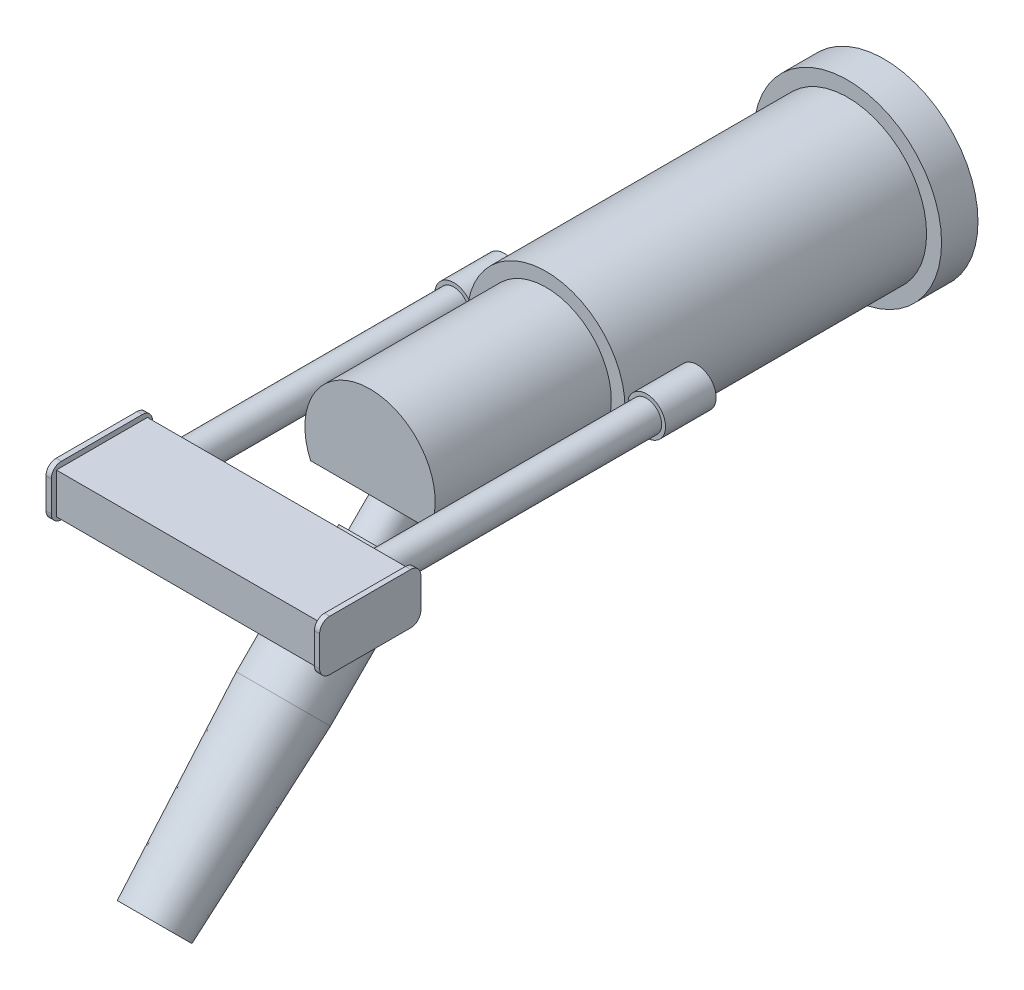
ISO-10303-21;
HEADER;
FILE_DESCRIPTION(('STEP AP214'),'2;1');
FILE_NAME('part.step','',(''),(''),'','','');
FILE_SCHEMA(('AUTOMOTIVE_DESIGN { 1 0 10303 214 1 1 1 1 }'));
ENDSEC;
DATA;
#1=APPLICATION_CONTEXT('core data for automotive mechanical design processes');
#2=APPLICATION_PROTOCOL_DEFINITION('international standard','automotive_design',2000,#1);
#3=PRODUCT_CONTEXT('',#1,'mechanical');
#4=PRODUCT('Part','Part','',(#3));
#5=PRODUCT_RELATED_PRODUCT_CATEGORY('part','',(#4));
#6=PRODUCT_DEFINITION_FORMATION('','',#4);
#7=PRODUCT_DEFINITION_CONTEXT('part definition',#1,'design');
#8=PRODUCT_DEFINITION('design','',#6,#7);
#9=PRODUCT_DEFINITION_SHAPE('','',#8);
#10=(LENGTH_UNIT() NAMED_UNIT(*) SI_UNIT(.MILLI.,.METRE.));
#11=(NAMED_UNIT(*) PLANE_ANGLE_UNIT() SI_UNIT($,.RADIAN.));
#12=(NAMED_UNIT(*) SI_UNIT($,.STERADIAN.) SOLID_ANGLE_UNIT());
#13=UNCERTAINTY_MEASURE_WITH_UNIT(LENGTH_MEASURE(1.E-05),#10,'distance_accuracy_value','');
#14=(GEOMETRIC_REPRESENTATION_CONTEXT(3) GLOBAL_UNCERTAINTY_ASSIGNED_CONTEXT((#13)) GLOBAL_UNIT_ASSIGNED_CONTEXT((#10,
#11,#12)) REPRESENTATION_CONTEXT('',''));
#15=CARTESIAN_POINT('',(0.,0.,0.));
#16=DIRECTION('',(0.,0.,1.));
#17=DIRECTION('',(1.,0.,0.));
#18=AXIS2_PLACEMENT_3D('',#15,#16,#17);
#19=CARTESIAN_POINT('',(0.,-181.25489002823,457.75929002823));
#20=DIRECTION('',(0.,0.707106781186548,-0.707106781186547));
#21=DIRECTION('',(0.,0.707106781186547,0.707106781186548));
#22=AXIS2_PLACEMENT_3D('',#19,#20,#21);
#23=PLANE('',#22);
#24=CARTESIAN_POINT('',(0.,-181.25489002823,457.75929002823));
#25=DIRECTION('',(0.,-0.707106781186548,0.707106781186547));
#26=DIRECTION('',(0.,-0.707106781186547,-0.707106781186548));
#27=AXIS2_PLACEMENT_3D('',#24,#25,#26);
#28=CIRCLE('',#27,19.1395542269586);
#29=CARTESIAN_POINT('',(0.,-194.788598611,444.22558144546));
#30=VERTEX_POINT('',#29);
#31=EDGE_CURVE('E60',#30,#30,#28,.T.);
#32=ORIENTED_EDGE('',*,*,#31,.T.);
#33=EDGE_LOOP('',(#32));
#34=FACE_BOUND('',#33,.T.);
#35=ADVANCED_FACE('F35',(#34),#23,.F.);
#36=CARTESIAN_POINT('',(0.,-30.8356,307.34));
#37=DIRECTION('',(0.,-0.707106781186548,0.707106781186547));
#38=DIRECTION('',(0.,-0.707106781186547,-0.707106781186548));
#39=AXIS2_PLACEMENT_3D('',#36,#37,#38);
#40=PLANE('',#39);
#41=CARTESIAN_POINT('',(0.,-30.8356,307.34));
#42=DIRECTION('',(0.,-0.707106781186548,0.707106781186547));
#43=DIRECTION('',(0.,-0.707106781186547,-0.707106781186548));
#44=AXIS2_PLACEMENT_3D('',#41,#42,#43);
#45=CIRCLE('',#44,12.573);
#46=CARTESIAN_POINT('',(0.,-39.7260535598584,298.449546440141));
#47=VERTEX_POINT('',#46);
#48=EDGE_CURVE('E11',#47,#47,#45,.T.);
#49=ORIENTED_EDGE('',*,*,#48,.F.);
#50=EDGE_LOOP('',(#49));
#51=FACE_BOUND('',#50,.T.);
#52=ADVANCED_FACE('F96',(#51),#40,.F.);
#53=CARTESIAN_POINT('',(0.,-30.8356,307.34));
#54=DIRECTION('',(0.,-0.707106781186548,0.707106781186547));
#55=DIRECTION('',(0.,-0.707106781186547,-0.707106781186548));
#56=AXIS2_PLACEMENT_3D('',#53,#54,#55);
#57=CYLINDRICAL_SURFACE('',#56,12.573);
#58=CARTESIAN_POINT('',(0.,-44.3059841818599,320.81038418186));
#59=DIRECTION('',(0.,-0.707106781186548,0.707106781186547));
#60=DIRECTION('',(0.,-0.707106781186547,-0.707106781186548));
#61=AXIS2_PLACEMENT_3D('',#58,#59,#60);
#62=CIRCLE('',#61,12.573);
#63=CARTESIAN_POINT('',(0.,-53.1964377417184,311.919930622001));
#64=VERTEX_POINT('',#63);
#65=EDGE_CURVE('E41',#64,#64,#62,.T.);
#66=ORIENTED_EDGE('',*,*,#65,.F.);
#67=EDGE_LOOP('',(#66));
#68=FACE_BOUND('',#67,.T.);
#69=ORIENTED_EDGE('',*,*,#48,.T.);
#70=EDGE_LOOP('',(#69));
#71=FACE_BOUND('',#70,.T.);
#72=ADVANCED_FACE('F91',(#68,#71),#57,.T.);
#73=CARTESIAN_POINT('',(0.,-35.4155306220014,329.700837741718));
#74=DIRECTION('',(0.,-0.707106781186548,0.707106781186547));
#75=DIRECTION('',(0.,-0.707106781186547,-0.707106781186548));
#76=AXIS2_PLACEMENT_3D('',#73,#74,#75);
#77=PLANE('',#76);
#78=CARTESIAN_POINT('',(0.,-44.3059841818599,320.81038418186));
#79=DIRECTION('',(0.,-0.707106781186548,0.707106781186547));
#80=DIRECTION('',(0.,-0.707106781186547,-0.707106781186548));
#81=AXIS2_PLACEMENT_3D('',#78,#79,#80);
#82=CIRCLE('',#81,17.4624999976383);
#83=CARTESIAN_POINT('',(0.,-56.65383634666,308.46253201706));
#84=VERTEX_POINT('',#83);
#85=EDGE_CURVE('E45',#84,#84,#82,.T.);
#86=ORIENTED_EDGE('',*,*,#85,.F.);
#87=EDGE_LOOP('',(#86));
#88=FACE_BOUND('',#87,.T.);
#89=ORIENTED_EDGE('',*,*,#65,.T.);
#90=EDGE_LOOP('',(#89));
#91=FACE_BOUND('',#90,.T.);
#92=ADVANCED_FACE('F86',(#88,#91),#77,.F.);
#93=CARTESIAN_POINT('',(0.,-30.8356,307.34));
#94=DIRECTION('',(0.,-0.707106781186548,0.707106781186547));
#95=DIRECTION('',(0.,-0.707106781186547,-0.707106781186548));
#96=AXIS2_PLACEMENT_3D('',#93,#94,#95);
#97=CYLINDRICAL_SURFACE('',#96,17.4624999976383);
#98=CARTESIAN_POINT('',(0.,-46.5510482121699,323.05544821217));
#99=DIRECTION('',(0.,-0.707106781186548,0.707106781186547));
#100=DIRECTION('',(0.,-0.707106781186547,-0.707106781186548));
#101=AXIS2_PLACEMENT_3D('',#98,#99,#100);
#102=CIRCLE('',#101,17.4624999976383);
#103=CARTESIAN_POINT('',(0.,-58.89890037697,310.70759604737));
#104=VERTEX_POINT('',#103);
#105=EDGE_CURVE('E49',#104,#104,#102,.T.);
#106=ORIENTED_EDGE('',*,*,#105,.F.);
#107=EDGE_LOOP('',(#106));
#108=FACE_BOUND('',#107,.T.);
#109=ORIENTED_EDGE('',*,*,#85,.T.);
#110=EDGE_LOOP('',(#109));
#111=FACE_BOUND('',#110,.T.);
#112=ADVANCED_FACE('F80',(#108,#111),#97,.T.);
#113=CARTESIAN_POINT('',(0.,-34.2031960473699,335.40330037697));
#114=DIRECTION('',(0.,-0.707106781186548,0.707106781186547));
#115=DIRECTION('',(0.,-0.707106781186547,-0.707106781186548));
#116=AXIS2_PLACEMENT_3D('',#113,#114,#115);
#117=PLANE('',#116);
#118=CARTESIAN_POINT('',(0.,-46.5510482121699,323.05544821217));
#119=DIRECTION('',(0.,-0.707106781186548,0.707106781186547));
#120=DIRECTION('',(0.,-0.707106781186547,-0.707106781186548));
#121=AXIS2_PLACEMENT_3D('',#118,#119,#120);
#122=CIRCLE('',#121,24.1299999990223);
#123=CARTESIAN_POINT('',(0.,-63.61353484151,305.99296158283));
#124=VERTEX_POINT('',#123);
#125=EDGE_CURVE('E54',#124,#124,#122,.T.);
#126=ORIENTED_EDGE('',*,*,#125,.F.);
#127=EDGE_LOOP('',(#126));
#128=FACE_BOUND('',#127,.T.);
#129=ORIENTED_EDGE('',*,*,#105,.T.);
#130=EDGE_LOOP('',(#129));
#131=FACE_BOUND('',#130,.T.);
#132=ADVANCED_FACE('F74',(#128,#131),#117,.F.);
#133=CARTESIAN_POINT('',(0.,-30.8356,307.34));
#134=DIRECTION('',(0.,-0.707106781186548,0.707106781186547));
#135=DIRECTION('',(0.,-0.707106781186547,-0.707106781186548));
#136=AXIS2_PLACEMENT_3D('',#133,#134,#135);
#137=CYLINDRICAL_SURFACE('',#136,24.1299999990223);
#138=CARTESIAN_POINT('',(0.,-100.43258493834,376.93698493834));
#139=DIRECTION('',(0.,-0.707106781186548,0.707106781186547));
#140=DIRECTION('',(0.,-0.707106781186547,-0.707106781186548));
#141=AXIS2_PLACEMENT_3D('',#138,#139,#140);
#142=CIRCLE('',#141,24.1299999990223);
#143=CARTESIAN_POINT('',(0.,-117.49507156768,359.874498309));
#144=VERTEX_POINT('',#143);
#145=EDGE_CURVE('E57',#144,#144,#142,.T.);
#146=ORIENTED_EDGE('',*,*,#145,.F.);
#147=EDGE_LOOP('',(#146));
#148=FACE_BOUND('',#147,.T.);
#149=ORIENTED_EDGE('',*,*,#125,.T.);
#150=EDGE_LOOP('',(#149));
#151=FACE_BOUND('',#150,.T.);
#152=ADVANCED_FACE('F68',(#148,#151),#137,.T.);
#153=CARTESIAN_POINT('',(0.,-100.43258493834,376.93698493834));
#154=DIRECTION('',(0.,0.707106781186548,-0.707106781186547));
#155=DIRECTION('',(0.,0.707106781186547,0.707106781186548));
#156=AXIS2_PLACEMENT_3D('',#153,#154,#155);
#157=CONICAL_SURFACE('',#156,24.1299999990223,0.0436332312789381);
#158=ORIENTED_EDGE('',*,*,#31,.F.);
#159=EDGE_LOOP('',(#158));
#160=FACE_BOUND('',#159,.T.);
#161=ORIENTED_EDGE('',*,*,#145,.T.);
#162=EDGE_LOOP('',(#161));
#163=FACE_BOUND('',#162,.T.);
#164=ADVANCED_FACE('F65',(#160,#163),#157,.T.);
#165=CLOSED_SHELL('',(#35,#52,#72,#92,#112,#132,#152,#164));
#166=MANIFOLD_SOLID_BREP('B2',#165);
#167=CARTESIAN_POINT('',(-85.852,9.52500000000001,433.705));
#168=DIRECTION('',(1.,0.,0.));
#169=DIRECTION('',(0.,0.,1.));
#170=AXIS2_PLACEMENT_3D('',#167,#168,#169);
#171=CYLINDRICAL_SURFACE('',#170,6.34999999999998);
#172=CARTESIAN_POINT('',(-82.5499999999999,9.52500000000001,433.705));
#173=DIRECTION('',(1.,0.,0.));
#174=DIRECTION('',(0.,0.,1.));
#175=AXIS2_PLACEMENT_3D('',#172,#173,#174);
#176=CIRCLE('',#175,6.34999999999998);
#177=CARTESIAN_POINT('',(-82.5499999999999,15.875,433.705));
#178=VERTEX_POINT('',#177);
#179=CARTESIAN_POINT('',(-82.5499999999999,9.52500000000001,440.055));
#180=VERTEX_POINT('',#179);
#181=EDGE_CURVE('E198',#178,#180,#176,.T.);
#182=ORIENTED_EDGE('',*,*,#181,.F.);
#183=DIRECTION('',(1.,0.,0.));
#184=VECTOR('',#183,1.);
#185=CARTESIAN_POINT('',(-85.852,15.875,433.705));
#186=LINE('',#185,#184);
#187=CARTESIAN_POINT('',(-85.852,15.875,433.705));
#188=VERTEX_POINT('',#187);
#189=EDGE_CURVE('E241',#188,#178,#186,.T.);
#190=ORIENTED_EDGE('',*,*,#189,.F.);
#191=CARTESIAN_POINT('',(-85.852,9.52500000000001,433.705));
#192=DIRECTION('',(1.,0.,0.));
#193=DIRECTION('',(0.,0.,1.));
#194=AXIS2_PLACEMENT_3D('',#191,#192,#193);
#195=CIRCLE('',#194,6.34999999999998);
#196=CARTESIAN_POINT('',(-85.852,9.52500000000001,440.055));
#197=VERTEX_POINT('',#196);
#198=EDGE_CURVE('E203',#188,#197,#195,.T.);
#199=ORIENTED_EDGE('',*,*,#198,.T.);
#200=DIRECTION('',(1.,0.,0.));
#201=VECTOR('',#200,1.);
#202=CARTESIAN_POINT('',(-85.852,9.52500000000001,440.055));
#203=LINE('',#202,#201);
#204=EDGE_CURVE('E33',#197,#180,#203,.T.);
#205=ORIENTED_EDGE('',*,*,#204,.T.);
#206=EDGE_LOOP('',(#182,#190,#199,#205));
#207=FACE_BOUND('',#206,.T.);
#208=ADVANCED_FACE('F126',(#207),#171,.T.);
#209=CARTESIAN_POINT('',(-85.852,9.52500000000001,440.055));
#210=DIRECTION('',(0.,0.,-1.));
#211=DIRECTION('',(1.,0.,0.));
#212=AXIS2_PLACEMENT_3D('',#209,#210,#211);
#213=PLANE('',#212);
#214=DIRECTION('',(0.,-1.,0.));
#215=VECTOR('',#214,1.);
#216=CARTESIAN_POINT('',(-82.5499999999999,9.52500000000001,440.055));
#217=LINE('',#216,#215);
#218=CARTESIAN_POINT('',(-82.5499999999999,-9.52500000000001,440.055));
#219=VERTEX_POINT('',#218);
#220=EDGE_CURVE('E189',#180,#219,#217,.T.);
#221=ORIENTED_EDGE('',*,*,#220,.F.);
#222=ORIENTED_EDGE('',*,*,#204,.F.);
#223=DIRECTION('',(0.,-1.,0.));
#224=VECTOR('',#223,1.);
#225=CARTESIAN_POINT('',(-85.852,9.52500000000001,440.055));
#226=LINE('',#225,#224);
#227=CARTESIAN_POINT('',(-85.852,-9.52500000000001,440.055));
#228=VERTEX_POINT('',#227);
#229=EDGE_CURVE('E223',#197,#228,#226,.T.);
#230=ORIENTED_EDGE('',*,*,#229,.T.);
#231=DIRECTION('',(1.,0.,0.));
#232=VECTOR('',#231,1.);
#233=CARTESIAN_POINT('',(-85.852,-9.52500000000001,440.055));
#234=LINE('',#233,#232);
#235=EDGE_CURVE('E133',#228,#219,#234,.T.);
#236=ORIENTED_EDGE('',*,*,#235,.T.);
#237=EDGE_LOOP('',(#221,#222,#230,#236));
#238=FACE_BOUND('',#237,.T.);
#239=ADVANCED_FACE('F190',(#238),#213,.F.);
#240=CARTESIAN_POINT('',(-85.852,-9.52500000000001,433.705));
#241=DIRECTION('',(1.,0.,0.));
#242=DIRECTION('',(0.,0.,1.));
#243=AXIS2_PLACEMENT_3D('',#240,#241,#242);
#244=CYLINDRICAL_SURFACE('',#243,6.34999999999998);
#245=CARTESIAN_POINT('',(-82.5499999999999,-9.52500000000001,433.705));
#246=DIRECTION('',(1.,0.,0.));
#247=DIRECTION('',(0.,0.,-1.));
#248=AXIS2_PLACEMENT_3D('',#245,#246,#247);
#249=CIRCLE('',#248,6.34999999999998);
#250=CARTESIAN_POINT('',(-82.5499999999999,-15.875,433.705));
#251=VERTEX_POINT('',#250);
#252=EDGE_CURVE('E197',#219,#251,#249,.T.);
#253=ORIENTED_EDGE('',*,*,#252,.F.);
#254=ORIENTED_EDGE('',*,*,#235,.F.);
#255=CARTESIAN_POINT('',(-85.852,-9.52500000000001,433.705));
#256=DIRECTION('',(1.,0.,0.));
#257=DIRECTION('',(0.,0.,-1.));
#258=AXIS2_PLACEMENT_3D('',#255,#256,#257);
#259=CIRCLE('',#258,6.34999999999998);
#260=CARTESIAN_POINT('',(-85.852,-15.875,433.705));
#261=VERTEX_POINT('',#260);
#262=EDGE_CURVE('E225',#228,#261,#259,.T.);
#263=ORIENTED_EDGE('',*,*,#262,.T.);
#264=DIRECTION('',(1.,0.,0.));
#265=VECTOR('',#264,1.);
#266=CARTESIAN_POINT('',(-85.852,-15.875,433.705));
#267=LINE('',#266,#265);
#268=EDGE_CURVE('E255',#261,#251,#267,.T.);
#269=ORIENTED_EDGE('',*,*,#268,.T.);
#270=EDGE_LOOP('',(#253,#254,#263,#269));
#271=FACE_BOUND('',#270,.T.);
#272=ADVANCED_FACE('F259',(#271),#244,.T.);
#273=CARTESIAN_POINT('',(-85.852,-15.875,433.705));
#274=DIRECTION('',(0.,1.,0.));
#275=DIRECTION('',(0.,0.,1.));
#276=AXIS2_PLACEMENT_3D('',#273,#274,#275);
#277=PLANE('',#276);
#278=DIRECTION('',(0.,0.,-1.));
#279=VECTOR('',#278,1.);
#280=CARTESIAN_POINT('',(-82.5499999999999,-15.875,433.705));
#281=LINE('',#280,#279);
#282=CARTESIAN_POINT('',(-82.5499999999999,-15.875,382.905));
#283=VERTEX_POINT('',#282);
#284=EDGE_CURVE('E210',#251,#283,#281,.T.);
#285=ORIENTED_EDGE('',*,*,#284,.F.);
#286=ORIENTED_EDGE('',*,*,#268,.F.);
#287=DIRECTION('',(0.,0.,-1.));
#288=VECTOR('',#287,1.);
#289=CARTESIAN_POINT('',(-85.852,-15.875,433.705));
#290=LINE('',#289,#288);
#291=CARTESIAN_POINT('',(-85.852,-15.875,382.905));
#292=VERTEX_POINT('',#291);
#293=EDGE_CURVE('E228',#261,#292,#290,.T.);
#294=ORIENTED_EDGE('',*,*,#293,.T.);
#295=DIRECTION('',(1.,0.,0.));
#296=VECTOR('',#295,1.);
#297=CARTESIAN_POINT('',(-85.852,-15.875,382.905));
#298=LINE('',#297,#296);
#299=EDGE_CURVE('E252',#292,#283,#298,.T.);
#300=ORIENTED_EDGE('',*,*,#299,.T.);
#301=EDGE_LOOP('',(#285,#286,#294,#300));
#302=FACE_BOUND('',#301,.T.);
#303=ADVANCED_FACE('F261',(#302),#277,.F.);
#304=CARTESIAN_POINT('',(-85.852,-9.52500000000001,382.905));
#305=DIRECTION('',(1.,0.,0.));
#306=DIRECTION('',(0.,0.,1.));
#307=AXIS2_PLACEMENT_3D('',#304,#305,#306);
#308=CYLINDRICAL_SURFACE('',#307,6.35000000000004);
#309=CARTESIAN_POINT('',(-82.5499999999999,-9.52500000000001,382.905));
#310=DIRECTION('',(1.,0.,0.));
#311=DIRECTION('',(0.,0.,1.));
#312=AXIS2_PLACEMENT_3D('',#309,#310,#311);
#313=CIRCLE('',#312,6.35000000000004);
#314=CARTESIAN_POINT('',(-82.5499999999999,-9.52500000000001,376.555));
#315=VERTEX_POINT('',#314);
#316=EDGE_CURVE('E213',#283,#315,#313,.T.);
#317=ORIENTED_EDGE('',*,*,#316,.F.);
#318=ORIENTED_EDGE('',*,*,#299,.F.);
#319=CARTESIAN_POINT('',(-85.852,-9.52500000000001,382.905));
#320=DIRECTION('',(1.,0.,0.));
#321=DIRECTION('',(0.,0.,1.));
#322=AXIS2_PLACEMENT_3D('',#319,#320,#321);
#323=CIRCLE('',#322,6.35000000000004);
#324=CARTESIAN_POINT('',(-85.852,-9.52500000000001,376.555));
#325=VERTEX_POINT('',#324);
#326=EDGE_CURVE('E231',#292,#325,#323,.T.);
#327=ORIENTED_EDGE('',*,*,#326,.T.);
#328=DIRECTION('',(1.,0.,0.));
#329=VECTOR('',#328,1.);
#330=CARTESIAN_POINT('',(-85.852,-9.52500000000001,376.555));
#331=LINE('',#330,#329);
#332=EDGE_CURVE('E249',#325,#315,#331,.T.);
#333=ORIENTED_EDGE('',*,*,#332,.T.);
#334=EDGE_LOOP('',(#317,#318,#327,#333));
#335=FACE_BOUND('',#334,.T.);
#336=ADVANCED_FACE('F264',(#335),#308,.T.);
#337=CARTESIAN_POINT('',(-85.852,-9.52500000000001,376.555));
#338=DIRECTION('',(0.,0.,1.));
#339=DIRECTION('',(-1.,0.,0.));
#340=AXIS2_PLACEMENT_3D('',#337,#338,#339);
#341=PLANE('',#340);
#342=DIRECTION('',(0.,1.,0.));
#343=VECTOR('',#342,1.);
#344=CARTESIAN_POINT('',(-82.5499999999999,-9.52500000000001,376.555));
#345=LINE('',#344,#343);
#346=CARTESIAN_POINT('',(-82.5499999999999,9.52500000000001,376.555));
#347=VERTEX_POINT('',#346);
#348=EDGE_CURVE('E216',#315,#347,#345,.T.);
#349=ORIENTED_EDGE('',*,*,#348,.F.);
#350=ORIENTED_EDGE('',*,*,#332,.F.);
#351=DIRECTION('',(0.,1.,0.));
#352=VECTOR('',#351,1.);
#353=CARTESIAN_POINT('',(-85.852,-9.52500000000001,376.555));
#354=LINE('',#353,#352);
#355=CARTESIAN_POINT('',(-85.852,9.52500000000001,376.555));
#356=VERTEX_POINT('',#355);
#357=EDGE_CURVE('E234',#325,#356,#354,.T.);
#358=ORIENTED_EDGE('',*,*,#357,.T.);
#359=DIRECTION('',(1.,0.,0.));
#360=VECTOR('',#359,1.);
#361=CARTESIAN_POINT('',(-85.852,9.52500000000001,376.555));
#362=LINE('',#361,#360);
#363=EDGE_CURVE('E246',#356,#347,#362,.T.);
#364=ORIENTED_EDGE('',*,*,#363,.T.);
#365=EDGE_LOOP('',(#349,#350,#358,#364));
#366=FACE_BOUND('',#365,.T.);
#367=ADVANCED_FACE('F267',(#366),#341,.F.);
#368=CARTESIAN_POINT('',(-85.852,9.52500000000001,382.905));
#369=DIRECTION('',(1.,0.,0.));
#370=DIRECTION('',(0.,0.,1.));
#371=AXIS2_PLACEMENT_3D('',#368,#369,#370);
#372=CYLINDRICAL_SURFACE('',#371,6.35000000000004);
#373=CARTESIAN_POINT('',(-82.5499999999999,9.52500000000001,382.905));
#374=DIRECTION('',(1.,0.,0.));
#375=DIRECTION('',(0.,0.,1.));
#376=AXIS2_PLACEMENT_3D('',#373,#374,#375);
#377=CIRCLE('',#376,6.35000000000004);
#378=CARTESIAN_POINT('',(-82.5499999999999,15.8750000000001,382.905));
#379=VERTEX_POINT('',#378);
#380=EDGE_CURVE('E219',#347,#379,#377,.T.);
#381=ORIENTED_EDGE('',*,*,#380,.F.);
#382=ORIENTED_EDGE('',*,*,#363,.F.);
#383=CARTESIAN_POINT('',(-85.852,9.52500000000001,382.905));
#384=DIRECTION('',(1.,0.,0.));
#385=DIRECTION('',(0.,0.,1.));
#386=AXIS2_PLACEMENT_3D('',#383,#384,#385);
#387=CIRCLE('',#386,6.35000000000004);
#388=CARTESIAN_POINT('',(-85.852,15.8750000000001,382.905));
#389=VERTEX_POINT('',#388);
#390=EDGE_CURVE('E237',#356,#389,#387,.T.);
#391=ORIENTED_EDGE('',*,*,#390,.T.);
#392=DIRECTION('',(1.,0.,0.));
#393=VECTOR('',#392,1.);
#394=CARTESIAN_POINT('',(-85.852,15.8750000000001,382.905));
#395=LINE('',#394,#393);
#396=EDGE_CURVE('E243',#389,#379,#395,.T.);
#397=ORIENTED_EDGE('',*,*,#396,.T.);
#398=EDGE_LOOP('',(#381,#382,#391,#397));
#399=FACE_BOUND('',#398,.T.);
#400=ADVANCED_FACE('F270',(#399),#372,.T.);
#401=CARTESIAN_POINT('',(-85.852,15.875,382.905));
#402=DIRECTION('',(0.,-1.,0.));
#403=DIRECTION('',(0.,0.,-1.));
#404=AXIS2_PLACEMENT_3D('',#401,#402,#403);
#405=PLANE('',#404);
#406=DIRECTION('',(0.,0.,1.));
#407=VECTOR('',#406,1.);
#408=CARTESIAN_POINT('',(-82.5499999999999,15.875,382.905));
#409=LINE('',#408,#407);
#410=EDGE_CURVE('E206',#379,#178,#409,.T.);
#411=ORIENTED_EDGE('',*,*,#410,.F.);
#412=ORIENTED_EDGE('',*,*,#396,.F.);
#413=DIRECTION('',(0.,0.,1.));
#414=VECTOR('',#413,1.);
#415=CARTESIAN_POINT('',(-85.852,15.875,382.905));
#416=LINE('',#415,#414);
#417=EDGE_CURVE('E140',#389,#188,#416,.T.);
#418=ORIENTED_EDGE('',*,*,#417,.T.);
#419=ORIENTED_EDGE('',*,*,#189,.T.);
#420=EDGE_LOOP('',(#411,#412,#418,#419));
#421=FACE_BOUND('',#420,.T.);
#422=ADVANCED_FACE('F271',(#421),#405,.F.);
#423=CARTESIAN_POINT('',(-85.852,9.52500000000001,433.705));
#424=DIRECTION('',(1.,0.,0.));
#425=DIRECTION('',(0.,0.,1.));
#426=AXIS2_PLACEMENT_3D('',#423,#424,#425);
#427=PLANE('',#426);
#428=ORIENTED_EDGE('',*,*,#198,.F.);
#429=ORIENTED_EDGE('',*,*,#417,.F.);
#430=ORIENTED_EDGE('',*,*,#390,.F.);
#431=ORIENTED_EDGE('',*,*,#357,.F.);
#432=ORIENTED_EDGE('',*,*,#326,.F.);
#433=ORIENTED_EDGE('',*,*,#293,.F.);
#434=ORIENTED_EDGE('',*,*,#262,.F.);
#435=ORIENTED_EDGE('',*,*,#229,.F.);
#436=EDGE_LOOP('',(#428,#429,#430,#431,#432,#433,#434,#435));
#437=FACE_BOUND('',#436,.T.);
#438=ADVANCED_FACE('F273',(#437),#427,.F.);
#439=CARTESIAN_POINT('',(-82.5499999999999,9.52500000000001,433.705));
#440=DIRECTION('',(1.,0.,0.));
#441=DIRECTION('',(0.,0.,1.));
#442=AXIS2_PLACEMENT_3D('',#439,#440,#441);
#443=PLANE('',#442);
#444=ORIENTED_EDGE('',*,*,#181,.T.);
#445=ORIENTED_EDGE('',*,*,#220,.T.);
#446=ORIENTED_EDGE('',*,*,#252,.T.);
#447=ORIENTED_EDGE('',*,*,#284,.T.);
#448=ORIENTED_EDGE('',*,*,#316,.T.);
#449=ORIENTED_EDGE('',*,*,#348,.T.);
#450=ORIENTED_EDGE('',*,*,#380,.T.);
#451=ORIENTED_EDGE('',*,*,#410,.T.);
#452=EDGE_LOOP('',(#444,#445,#446,#447,#448,#449,#450,#451));
#453=FACE_BOUND('',#452,.T.);
#454=ADVANCED_FACE('F204',(#453),#443,.T.);
#455=CLOSED_SHELL('',(#208,#239,#272,#303,#336,#367,#400,#422,#438,#454));
#456=MANIFOLD_SOLID_BREP('B6',#455);
#457=CARTESIAN_POINT('',(-60.4519999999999,0.,379.73));
#458=DIRECTION('',(0.,0.,-1.));
#459=DIRECTION('',(1.,0.,0.));
#460=AXIS2_PLACEMENT_3D('',#457,#458,#459);
#461=CYLINDRICAL_SURFACE('',#460,9.52500000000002);
#462=CARTESIAN_POINT('',(-60.4519999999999,0.,379.73));
#463=DIRECTION('',(0.,0.,-1.));
#464=DIRECTION('',(-1.,0.,0.));
#465=AXIS2_PLACEMENT_3D('',#462,#463,#464);
#466=CIRCLE('',#465,9.52500000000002);
#467=CARTESIAN_POINT('',(-69.977,0.,379.73));
#468=VERTEX_POINT('',#467);
#469=EDGE_CURVE('E125',#468,#468,#466,.T.);
#470=ORIENTED_EDGE('',*,*,#469,.T.);
#471=EDGE_LOOP('',(#470));
#472=FACE_BOUND('',#471,.T.);
#473=CARTESIAN_POINT('',(-60.4519999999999,0.,209.55));
#474=DIRECTION('',(0.,0.,-1.));
#475=DIRECTION('',(-1.,0.,0.));
#476=AXIS2_PLACEMENT_3D('',#473,#474,#475);
#477=CIRCLE('',#476,9.52500000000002);
#478=CARTESIAN_POINT('',(-69.977,0.,209.55));
#479=VERTEX_POINT('',#478);
#480=EDGE_CURVE('E327',#479,#479,#477,.T.);
#481=ORIENTED_EDGE('',*,*,#480,.F.);
#482=EDGE_LOOP('',(#481));
#483=FACE_BOUND('',#482,.T.);
#484=ADVANCED_FACE('F321',(#472,#483),#461,.T.);
#485=CARTESIAN_POINT('',(-60.4519999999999,0.,379.73));
#486=DIRECTION('',(0.,0.,1.));
#487=DIRECTION('',(-1.,0.,0.));
#488=AXIS2_PLACEMENT_3D('',#485,#486,#487);
#489=PLANE('',#488);
#490=ORIENTED_EDGE('',*,*,#469,.F.);
#491=EDGE_LOOP('',(#490));
#492=FACE_BOUND('',#491,.T.);
#493=ADVANCED_FACE('F336',(#492),#489,.T.);
#494=CARTESIAN_POINT('',(-60.4519999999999,0.,209.55));
#495=DIRECTION('',(0.,0.,1.));
#496=DIRECTION('',(-1.,0.,0.));
#497=AXIS2_PLACEMENT_3D('',#494,#495,#496);
#498=PLANE('',#497);
#499=ORIENTED_EDGE('',*,*,#480,.T.);
#500=EDGE_LOOP('',(#499));
#501=FACE_BOUND('',#500,.T.);
#502=ADVANCED_FACE('F333',(#501),#498,.F.);
#503=CLOSED_SHELL('',(#484,#493,#502));
#504=MANIFOLD_SOLID_BREP('B27',#503);
#505=CARTESIAN_POINT('',(-60.4519999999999,0.,209.55));
#506=DIRECTION('',(0.,0.,-1.));
#507=DIRECTION('',(1.,0.,0.));
#508=AXIS2_PLACEMENT_3D('',#505,#506,#507);
#509=CYLINDRICAL_SURFACE('',#508,11.938);
#510=CARTESIAN_POINT('',(-60.4519999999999,0.,209.55));
#511=DIRECTION('',(0.,0.,-1.));
#512=DIRECTION('',(-1.,0.,0.));
#513=AXIS2_PLACEMENT_3D('',#510,#511,#512);
#514=CIRCLE('',#513,11.938);
#515=CARTESIAN_POINT('',(-72.3899999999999,0.,209.55));
#516=VERTEX_POINT('',#515);
#517=EDGE_CURVE('E320',#516,#516,#514,.T.);
#518=ORIENTED_EDGE('',*,*,#517,.T.);
#519=EDGE_LOOP('',(#518));
#520=FACE_BOUND('',#519,.T.);
#521=CARTESIAN_POINT('',(-60.4519999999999,0.,177.8));
#522=DIRECTION('',(0.,0.,-1.));
#523=DIRECTION('',(-1.,0.,0.));
#524=AXIS2_PLACEMENT_3D('',#521,#522,#523);
#525=CIRCLE('',#524,11.938);
#526=CARTESIAN_POINT('',(-72.3899999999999,0.,177.8));
#527=VERTEX_POINT('',#526);
#528=EDGE_CURVE('E365',#527,#527,#525,.T.);
#529=ORIENTED_EDGE('',*,*,#528,.F.);
#530=EDGE_LOOP('',(#529));
#531=FACE_BOUND('',#530,.T.);
#532=ADVANCED_FACE('F359',(#520,#531),#509,.T.);
#533=CARTESIAN_POINT('',(-60.4519999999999,0.,209.55));
#534=DIRECTION('',(0.,0.,1.));
#535=DIRECTION('',(-1.,0.,0.));
#536=AXIS2_PLACEMENT_3D('',#533,#534,#535);
#537=PLANE('',#536);
#538=ORIENTED_EDGE('',*,*,#517,.F.);
#539=EDGE_LOOP('',(#538));
#540=FACE_BOUND('',#539,.T.);
#541=ADVANCED_FACE('F374',(#540),#537,.T.);
#542=CARTESIAN_POINT('',(-60.4519999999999,0.,177.8));
#543=DIRECTION('',(0.,0.,1.));
#544=DIRECTION('',(-1.,0.,0.));
#545=AXIS2_PLACEMENT_3D('',#542,#543,#544);
#546=PLANE('',#545);
#547=ORIENTED_EDGE('',*,*,#528,.T.);
#548=EDGE_LOOP('',(#547));
#549=FACE_BOUND('',#548,.T.);
#550=ADVANCED_FACE('F371',(#549),#546,.F.);
#551=CLOSED_SHELL('',(#532,#541,#550));
#552=MANIFOLD_SOLID_BREP('B120',#551);
#553=CARTESIAN_POINT('',(85.852,9.52500000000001,433.705));
#554=DIRECTION('',(-1.,0.,0.));
#555=DIRECTION('',(0.,0.,1.));
#556=AXIS2_PLACEMENT_3D('',#553,#554,#555);
#557=CYLINDRICAL_SURFACE('',#556,6.34999999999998);
#558=CARTESIAN_POINT('',(82.5499999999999,9.52500000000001,433.705));
#559=DIRECTION('',(1.,0.,0.));
#560=DIRECTION('',(0.,0.,1.));
#561=AXIS2_PLACEMENT_3D('',#558,#559,#560);
#562=CIRCLE('',#561,6.34999999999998);
#563=CARTESIAN_POINT('',(82.5499999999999,15.875,433.705));
#564=VERTEX_POINT('',#563);
#565=CARTESIAN_POINT('',(82.5499999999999,9.52500000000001,440.055));
#566=VERTEX_POINT('',#565);
#567=EDGE_CURVE('E465',#564,#566,#562,.T.);
#568=ORIENTED_EDGE('',*,*,#567,.T.);
#569=DIRECTION('',(-1.,0.,0.));
#570=VECTOR('',#569,1.);
#571=CARTESIAN_POINT('',(85.852,9.52500000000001,440.055));
#572=LINE('',#571,#570);
#573=CARTESIAN_POINT('',(85.852,9.52500000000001,440.055));
#574=VERTEX_POINT('',#573);
#575=EDGE_CURVE('E357',#574,#566,#572,.T.);
#576=ORIENTED_EDGE('',*,*,#575,.F.);
#577=CARTESIAN_POINT('',(85.852,9.52500000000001,433.705));
#578=DIRECTION('',(1.,0.,0.));
#579=DIRECTION('',(0.,0.,1.));
#580=AXIS2_PLACEMENT_3D('',#577,#578,#579);
#581=CIRCLE('',#580,6.34999999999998);
#582=CARTESIAN_POINT('',(85.852,15.875,433.705));
#583=VERTEX_POINT('',#582);
#584=EDGE_CURVE('E492',#583,#574,#581,.T.);
#585=ORIENTED_EDGE('',*,*,#584,.F.);
#586=DIRECTION('',(-1.,0.,0.));
#587=VECTOR('',#586,1.);
#588=CARTESIAN_POINT('',(85.852,15.875,433.705));
#589=LINE('',#588,#587);
#590=EDGE_CURVE('E478',#583,#564,#589,.T.);
#591=ORIENTED_EDGE('',*,*,#590,.T.);
#592=EDGE_LOOP('',(#568,#576,#585,#591));
#593=FACE_BOUND('',#592,.T.);
#594=ADVANCED_FACE('F397',(#593),#557,.T.);
#595=CARTESIAN_POINT('',(85.852,9.52500000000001,440.055));
#596=DIRECTION('',(0.,0.,-1.));
#597=DIRECTION('',(-1.,0.,0.));
#598=AXIS2_PLACEMENT_3D('',#595,#596,#597);
#599=PLANE('',#598);
#600=DIRECTION('',(0.,-1.,0.));
#601=VECTOR('',#600,1.);
#602=CARTESIAN_POINT('',(82.5499999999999,9.52500000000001,440.055));
#603=LINE('',#602,#601);
#604=CARTESIAN_POINT('',(82.5499999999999,-9.52500000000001,440.055));
#605=VERTEX_POINT('',#604);
#606=EDGE_CURVE('E461',#566,#605,#603,.T.);
#607=ORIENTED_EDGE('',*,*,#606,.T.);
#608=DIRECTION('',(-1.,0.,0.));
#609=VECTOR('',#608,1.);
#610=CARTESIAN_POINT('',(85.852,-9.52500000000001,440.055));
#611=LINE('',#610,#609);
#612=CARTESIAN_POINT('',(85.852,-9.52500000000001,440.055));
#613=VERTEX_POINT('',#612);
#614=EDGE_CURVE('E404',#613,#605,#611,.T.);
#615=ORIENTED_EDGE('',*,*,#614,.F.);
#616=DIRECTION('',(0.,-1.,0.));
#617=VECTOR('',#616,1.);
#618=CARTESIAN_POINT('',(85.852,9.52500000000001,440.055));
#619=LINE('',#618,#617);
#620=EDGE_CURVE('E474',#574,#613,#619,.T.);
#621=ORIENTED_EDGE('',*,*,#620,.F.);
#622=ORIENTED_EDGE('',*,*,#575,.T.);
#623=EDGE_LOOP('',(#607,#615,#621,#622));
#624=FACE_BOUND('',#623,.T.);
#625=ADVANCED_FACE('F473',(#624),#599,.F.);
#626=CARTESIAN_POINT('',(85.852,-9.52500000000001,433.705));
#627=DIRECTION('',(-1.,0.,0.));
#628=DIRECTION('',(0.,0.,1.));
#629=AXIS2_PLACEMENT_3D('',#626,#627,#628);
#630=CYLINDRICAL_SURFACE('',#629,6.34999999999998);
#631=CARTESIAN_POINT('',(82.5499999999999,-9.52500000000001,433.705));
#632=DIRECTION('',(1.,0.,0.));
#633=DIRECTION('',(0.,0.,-1.));
#634=AXIS2_PLACEMENT_3D('',#631,#632,#633);
#635=CIRCLE('',#634,6.34999999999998);
#636=CARTESIAN_POINT('',(82.5499999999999,-15.875,433.705));
#637=VERTEX_POINT('',#636);
#638=EDGE_CURVE('E467',#605,#637,#635,.T.);
#639=ORIENTED_EDGE('',*,*,#638,.T.);
#640=DIRECTION('',(-1.,0.,0.));
#641=VECTOR('',#640,1.);
#642=CARTESIAN_POINT('',(85.852,-15.875,433.705));
#643=LINE('',#642,#641);
#644=CARTESIAN_POINT('',(85.852,-15.875,433.705));
#645=VERTEX_POINT('',#644);
#646=EDGE_CURVE('E518',#645,#637,#643,.T.);
#647=ORIENTED_EDGE('',*,*,#646,.F.);
#648=CARTESIAN_POINT('',(85.852,-9.52500000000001,433.705));
#649=DIRECTION('',(1.,0.,0.));
#650=DIRECTION('',(0.,0.,-1.));
#651=AXIS2_PLACEMENT_3D('',#648,#649,#650);
#652=CIRCLE('',#651,6.34999999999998);
#653=EDGE_CURVE('E495',#613,#645,#652,.T.);
#654=ORIENTED_EDGE('',*,*,#653,.F.);
#655=ORIENTED_EDGE('',*,*,#614,.T.);
#656=EDGE_LOOP('',(#639,#647,#654,#655));
#657=FACE_BOUND('',#656,.T.);
#658=ADVANCED_FACE('F522',(#657),#630,.T.);
#659=CARTESIAN_POINT('',(85.852,-15.875,433.705));
#660=DIRECTION('',(0.,1.,0.));
#661=DIRECTION('',(0.,0.,1.));
#662=AXIS2_PLACEMENT_3D('',#659,#660,#661);
#663=PLANE('',#662);
#664=DIRECTION('',(0.,0.,-1.));
#665=VECTOR('',#664,1.);
#666=CARTESIAN_POINT('',(82.5499999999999,-15.875,433.705));
#667=LINE('',#666,#665);
#668=CARTESIAN_POINT('',(82.5499999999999,-15.875,382.905));
#669=VERTEX_POINT('',#668);
#670=EDGE_CURVE('E482',#637,#669,#667,.T.);
#671=ORIENTED_EDGE('',*,*,#670,.T.);
#672=DIRECTION('',(-1.,0.,0.));
#673=VECTOR('',#672,1.);
#674=CARTESIAN_POINT('',(85.852,-15.875,382.905));
#675=LINE('',#674,#673);
#676=CARTESIAN_POINT('',(85.852,-15.875,382.905));
#677=VERTEX_POINT('',#676);
#678=EDGE_CURVE('E515',#677,#669,#675,.T.);
#679=ORIENTED_EDGE('',*,*,#678,.F.);
#680=DIRECTION('',(0.,0.,-1.));
#681=VECTOR('',#680,1.);
#682=CARTESIAN_POINT('',(85.852,-15.875,433.705));
#683=LINE('',#682,#681);
#684=EDGE_CURVE('E497',#645,#677,#683,.T.);
#685=ORIENTED_EDGE('',*,*,#684,.F.);
#686=ORIENTED_EDGE('',*,*,#646,.T.);
#687=EDGE_LOOP('',(#671,#679,#685,#686));
#688=FACE_BOUND('',#687,.T.);
#689=ADVANCED_FACE('F530',(#688),#663,.F.);
#690=CARTESIAN_POINT('',(85.852,-9.52500000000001,382.905));
#691=DIRECTION('',(-1.,0.,0.));
#692=DIRECTION('',(0.,0.,1.));
#693=AXIS2_PLACEMENT_3D('',#690,#691,#692);
#694=CYLINDRICAL_SURFACE('',#693,6.35000000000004);
#695=CARTESIAN_POINT('',(82.5499999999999,-9.52500000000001,382.905));
#696=DIRECTION('',(1.,0.,0.));
#697=DIRECTION('',(0.,0.,1.));
#698=AXIS2_PLACEMENT_3D('',#695,#696,#697);
#699=CIRCLE('',#698,6.35000000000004);
#700=CARTESIAN_POINT('',(82.5499999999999,-9.52500000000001,376.555));
#701=VERTEX_POINT('',#700);
#702=EDGE_CURVE('E484',#669,#701,#699,.T.);
#703=ORIENTED_EDGE('',*,*,#702,.T.);
#704=DIRECTION('',(-1.,0.,0.));
#705=VECTOR('',#704,1.);
#706=CARTESIAN_POINT('',(85.852,-9.52500000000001,376.555));
#707=LINE('',#706,#705);
#708=CARTESIAN_POINT('',(85.852,-9.52500000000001,376.555));
#709=VERTEX_POINT('',#708);
#710=EDGE_CURVE('E512',#709,#701,#707,.T.);
#711=ORIENTED_EDGE('',*,*,#710,.F.);
#712=CARTESIAN_POINT('',(85.852,-9.52500000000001,382.905));
#713=DIRECTION('',(1.,0.,0.));
#714=DIRECTION('',(0.,0.,1.));
#715=AXIS2_PLACEMENT_3D('',#712,#713,#714);
#716=CIRCLE('',#715,6.35000000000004);
#717=EDGE_CURVE('E499',#677,#709,#716,.T.);
#718=ORIENTED_EDGE('',*,*,#717,.F.);
#719=ORIENTED_EDGE('',*,*,#678,.T.);
#720=EDGE_LOOP('',(#703,#711,#718,#719));
#721=FACE_BOUND('',#720,.T.);
#722=ADVANCED_FACE('F533',(#721),#694,.T.);
#723=CARTESIAN_POINT('',(85.852,-9.52500000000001,376.555));
#724=DIRECTION('',(0.,0.,1.));
#725=DIRECTION('',(1.,0.,0.));
#726=AXIS2_PLACEMENT_3D('',#723,#724,#725);
#727=PLANE('',#726);
#728=DIRECTION('',(0.,1.,0.));
#729=VECTOR('',#728,1.);
#730=CARTESIAN_POINT('',(82.5499999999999,-9.52500000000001,376.555));
#731=LINE('',#730,#729);
#732=CARTESIAN_POINT('',(82.5499999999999,9.52500000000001,376.555));
#733=VERTEX_POINT('',#732);
#734=EDGE_CURVE('E486',#701,#733,#731,.T.);
#735=ORIENTED_EDGE('',*,*,#734,.T.);
#736=DIRECTION('',(-1.,0.,0.));
#737=VECTOR('',#736,1.);
#738=CARTESIAN_POINT('',(85.852,9.52500000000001,376.555));
#739=LINE('',#738,#737);
#740=CARTESIAN_POINT('',(85.852,9.52500000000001,376.555));
#741=VERTEX_POINT('',#740);
#742=EDGE_CURVE('E509',#741,#733,#739,.T.);
#743=ORIENTED_EDGE('',*,*,#742,.F.);
#744=DIRECTION('',(0.,1.,0.));
#745=VECTOR('',#744,1.);
#746=CARTESIAN_POINT('',(85.852,-9.52500000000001,376.555));
#747=LINE('',#746,#745);
#748=EDGE_CURVE('E501',#709,#741,#747,.T.);
#749=ORIENTED_EDGE('',*,*,#748,.F.);
#750=ORIENTED_EDGE('',*,*,#710,.T.);
#751=EDGE_LOOP('',(#735,#743,#749,#750));
#752=FACE_BOUND('',#751,.T.);
#753=ADVANCED_FACE('F538',(#752),#727,.F.);
#754=CARTESIAN_POINT('',(85.852,9.52500000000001,382.905));
#755=DIRECTION('',(-1.,0.,0.));
#756=DIRECTION('',(0.,0.,1.));
#757=AXIS2_PLACEMENT_3D('',#754,#755,#756);
#758=CYLINDRICAL_SURFACE('',#757,6.35000000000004);
#759=CARTESIAN_POINT('',(82.5499999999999,9.52500000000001,382.905));
#760=DIRECTION('',(1.,0.,0.));
#761=DIRECTION('',(0.,0.,1.));
#762=AXIS2_PLACEMENT_3D('',#759,#760,#761);
#763=CIRCLE('',#762,6.35000000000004);
#764=CARTESIAN_POINT('',(82.5499999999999,15.8750000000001,382.905));
#765=VERTEX_POINT('',#764);
#766=EDGE_CURVE('E488',#733,#765,#763,.T.);
#767=ORIENTED_EDGE('',*,*,#766,.T.);
#768=DIRECTION('',(-1.,0.,0.));
#769=VECTOR('',#768,1.);
#770=CARTESIAN_POINT('',(85.852,15.8750000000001,382.905));
#771=LINE('',#770,#769);
#772=CARTESIAN_POINT('',(85.852,15.8750000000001,382.905));
#773=VERTEX_POINT('',#772);
#774=EDGE_CURVE('E506',#773,#765,#771,.T.);
#775=ORIENTED_EDGE('',*,*,#774,.F.);
#776=CARTESIAN_POINT('',(85.852,9.52500000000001,382.905));
#777=DIRECTION('',(1.,0.,0.));
#778=DIRECTION('',(0.,0.,1.));
#779=AXIS2_PLACEMENT_3D('',#776,#777,#778);
#780=CIRCLE('',#779,6.35000000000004);
#781=EDGE_CURVE('E416',#741,#773,#780,.T.);
#782=ORIENTED_EDGE('',*,*,#781,.F.);
#783=ORIENTED_EDGE('',*,*,#742,.T.);
#784=EDGE_LOOP('',(#767,#775,#782,#783));
#785=FACE_BOUND('',#784,.T.);
#786=ADVANCED_FACE('F541',(#785),#758,.T.);
#787=CARTESIAN_POINT('',(85.852,15.875,382.905));
#788=DIRECTION('',(0.,-1.,0.));
#789=DIRECTION('',(0.,0.,-1.));
#790=AXIS2_PLACEMENT_3D('',#787,#788,#789);
#791=PLANE('',#790);
#792=DIRECTION('',(0.,0.,1.));
#793=VECTOR('',#792,1.);
#794=CARTESIAN_POINT('',(82.5499999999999,15.875,382.905));
#795=LINE('',#794,#793);
#796=EDGE_CURVE('E490',#765,#564,#795,.T.);
#797=ORIENTED_EDGE('',*,*,#796,.T.);
#798=ORIENTED_EDGE('',*,*,#590,.F.);
#799=DIRECTION('',(0.,0.,1.));
#800=VECTOR('',#799,1.);
#801=CARTESIAN_POINT('',(85.852,15.875,382.905));
#802=LINE('',#801,#800);
#803=EDGE_CURVE('E411',#773,#583,#802,.T.);
#804=ORIENTED_EDGE('',*,*,#803,.F.);
#805=ORIENTED_EDGE('',*,*,#774,.T.);
#806=EDGE_LOOP('',(#797,#798,#804,#805));
#807=FACE_BOUND('',#806,.T.);
#808=ADVANCED_FACE('F543',(#807),#791,.F.);
#809=CARTESIAN_POINT('',(85.852,9.52500000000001,433.705));
#810=DIRECTION('',(-1.,0.,0.));
#811=DIRECTION('',(0.,0.,1.));
#812=AXIS2_PLACEMENT_3D('',#809,#810,#811);
#813=PLANE('',#812);
#814=ORIENTED_EDGE('',*,*,#584,.T.);
#815=ORIENTED_EDGE('',*,*,#620,.T.);
#816=ORIENTED_EDGE('',*,*,#653,.T.);
#817=ORIENTED_EDGE('',*,*,#684,.T.);
#818=ORIENTED_EDGE('',*,*,#717,.T.);
#819=ORIENTED_EDGE('',*,*,#748,.T.);
#820=ORIENTED_EDGE('',*,*,#781,.T.);
#821=ORIENTED_EDGE('',*,*,#803,.T.);
#822=EDGE_LOOP('',(#814,#815,#816,#817,#818,#819,#820,#821));
#823=FACE_BOUND('',#822,.T.);
#824=ADVANCED_FACE('F525',(#823),#813,.F.);
#825=CARTESIAN_POINT('',(82.5499999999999,9.52500000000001,433.705));
#826=DIRECTION('',(-1.,0.,0.));
#827=DIRECTION('',(0.,0.,1.));
#828=AXIS2_PLACEMENT_3D('',#825,#826,#827);
#829=PLANE('',#828);
#830=ORIENTED_EDGE('',*,*,#567,.F.);
#831=ORIENTED_EDGE('',*,*,#796,.F.);
#832=ORIENTED_EDGE('',*,*,#766,.F.);
#833=ORIENTED_EDGE('',*,*,#734,.F.);
#834=ORIENTED_EDGE('',*,*,#702,.F.);
#835=ORIENTED_EDGE('',*,*,#670,.F.);
#836=ORIENTED_EDGE('',*,*,#638,.F.);
#837=ORIENTED_EDGE('',*,*,#606,.F.);
#838=EDGE_LOOP('',(#830,#831,#832,#833,#834,#835,#836,#837));
#839=FACE_BOUND('',#838,.T.);
#840=ADVANCED_FACE('F462',(#839),#829,.T.);
#841=CLOSED_SHELL('',(#594,#625,#658,#689,#722,#753,#786,#808,#824,#840));
#842=MANIFOLD_SOLID_BREP('B315',#841);
#843=CARTESIAN_POINT('',(-82.5499999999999,-12.7,436.88));
#844=DIRECTION('',(1.,0.,0.));
#845=DIRECTION('',(0.,0.,-1.));
#846=AXIS2_PLACEMENT_3D('',#843,#844,#845);
#847=PLANE('',#846);
#848=DIRECTION('',(0.,-1.,0.));
#849=VECTOR('',#848,1.);
#850=CARTESIAN_POINT('',(-82.5499999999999,-12.7,379.73));
#851=LINE('',#850,#849);
#852=CARTESIAN_POINT('',(-82.5499999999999,12.7,379.73));
#853=VERTEX_POINT('',#852);
#854=CARTESIAN_POINT('',(-82.5499999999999,-12.7,379.73));
#855=VERTEX_POINT('',#854);
#856=EDGE_CURVE('E636',#853,#855,#851,.T.);
#857=ORIENTED_EDGE('',*,*,#856,.T.);
#858=DIRECTION('',(0.,0.,-1.));
#859=VECTOR('',#858,1.);
#860=CARTESIAN_POINT('',(-82.5499999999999,-12.7,436.88));
#861=LINE('',#860,#859);
#862=CARTESIAN_POINT('',(-82.5499999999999,-12.7,436.88));
#863=VERTEX_POINT('',#862);
#864=EDGE_CURVE('E395',#863,#855,#861,.T.);
#865=ORIENTED_EDGE('',*,*,#864,.F.);
#866=DIRECTION('',(0.,-1.,0.));
#867=VECTOR('',#866,1.);
#868=CARTESIAN_POINT('',(-82.5499999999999,-12.7,436.88));
#869=LINE('',#868,#867);
#870=CARTESIAN_POINT('',(-82.5499999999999,12.7,436.88));
#871=VERTEX_POINT('',#870);
#872=EDGE_CURVE('E654',#871,#863,#869,.T.);
#873=ORIENTED_EDGE('',*,*,#872,.F.);
#874=DIRECTION('',(0.,0.,-1.));
#875=VECTOR('',#874,1.);
#876=CARTESIAN_POINT('',(-82.5499999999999,12.7,436.88));
#877=LINE('',#876,#875);
#878=EDGE_CURVE('E648',#871,#853,#877,.T.);
#879=ORIENTED_EDGE('',*,*,#878,.T.);
#880=EDGE_LOOP('',(#857,#865,#873,#879));
#881=FACE_BOUND('',#880,.T.);
#882=ADVANCED_FACE('F592',(#881),#847,.F.);
#883=CARTESIAN_POINT('',(-82.5499999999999,-12.7,436.88));
#884=DIRECTION('',(0.,1.,0.));
#885=DIRECTION('',(0.,0.,1.));
#886=AXIS2_PLACEMENT_3D('',#883,#884,#885);
#887=PLANE('',#886);
#888=DIRECTION('',(1.,0.,0.));
#889=VECTOR('',#888,1.);
#890=CARTESIAN_POINT('',(-82.5499999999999,-12.7,379.73));
#891=LINE('',#890,#889);
#892=CARTESIAN_POINT('',(82.5499999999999,-12.7,379.73));
#893=VERTEX_POINT('',#892);
#894=EDGE_CURVE('E632',#855,#893,#891,.T.);
#895=ORIENTED_EDGE('',*,*,#894,.T.);
#896=DIRECTION('',(0.,0.,-1.));
#897=VECTOR('',#896,1.);
#898=CARTESIAN_POINT('',(82.5499999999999,-12.7,436.88));
#899=LINE('',#898,#897);
#900=CARTESIAN_POINT('',(82.5499999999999,-12.7,436.88));
#901=VERTEX_POINT('',#900);
#902=EDGE_CURVE('E599',#901,#893,#899,.T.);
#903=ORIENTED_EDGE('',*,*,#902,.F.);
#904=DIRECTION('',(1.,0.,0.));
#905=VECTOR('',#904,1.);
#906=CARTESIAN_POINT('',(-82.5499999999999,-12.7,436.88));
#907=LINE('',#906,#905);
#908=EDGE_CURVE('E644',#863,#901,#907,.T.);
#909=ORIENTED_EDGE('',*,*,#908,.F.);
#910=ORIENTED_EDGE('',*,*,#864,.T.);
#911=EDGE_LOOP('',(#895,#903,#909,#910));
#912=FACE_BOUND('',#911,.T.);
#913=ADVANCED_FACE('F643',(#912),#887,.F.);
#914=CARTESIAN_POINT('',(82.5499999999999,-12.7,436.88));
#915=DIRECTION('',(-1.,0.,0.));
#916=DIRECTION('',(0.,0.,1.));
#917=AXIS2_PLACEMENT_3D('',#914,#915,#916);
#918=PLANE('',#917);
#919=DIRECTION('',(0.,1.,0.));
#920=VECTOR('',#919,1.);
#921=CARTESIAN_POINT('',(82.5499999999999,-12.7,379.73));
#922=LINE('',#921,#920);
#923=CARTESIAN_POINT('',(82.5499999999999,12.7,379.73));
#924=VERTEX_POINT('',#923);
#925=EDGE_CURVE('E637',#893,#924,#922,.T.);
#926=ORIENTED_EDGE('',*,*,#925,.T.);
#927=DIRECTION('',(0.,0.,-1.));
#928=VECTOR('',#927,1.);
#929=CARTESIAN_POINT('',(82.5499999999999,12.7,436.88));
#930=LINE('',#929,#928);
#931=CARTESIAN_POINT('',(82.5499999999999,12.7,436.88));
#932=VERTEX_POINT('',#931);
#933=EDGE_CURVE('E660',#932,#924,#930,.T.);
#934=ORIENTED_EDGE('',*,*,#933,.F.);
#935=DIRECTION('',(0.,1.,0.));
#936=VECTOR('',#935,1.);
#937=CARTESIAN_POINT('',(82.5499999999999,-12.7,436.88));
#938=LINE('',#937,#936);
#939=EDGE_CURVE('E611',#901,#932,#938,.T.);
#940=ORIENTED_EDGE('',*,*,#939,.F.);
#941=ORIENTED_EDGE('',*,*,#902,.T.);
#942=EDGE_LOOP('',(#926,#934,#940,#941));
#943=FACE_BOUND('',#942,.T.);
#944=ADVANCED_FACE('F663',(#943),#918,.F.);
#945=CARTESIAN_POINT('',(-82.5499999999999,12.7,436.88));
#946=DIRECTION('',(0.,-1.,0.));
#947=DIRECTION('',(0.,0.,-1.));
#948=AXIS2_PLACEMENT_3D('',#945,#946,#947);
#949=PLANE('',#948);
#950=DIRECTION('',(-1.,0.,0.));
#951=VECTOR('',#950,1.);
#952=CARTESIAN_POINT('',(-82.5499999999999,12.7,379.73));
#953=LINE('',#952,#951);
#954=EDGE_CURVE('E652',#924,#853,#953,.T.);
#955=ORIENTED_EDGE('',*,*,#954,.T.);
#956=ORIENTED_EDGE('',*,*,#878,.F.);
#957=DIRECTION('',(-1.,0.,0.));
#958=VECTOR('',#957,1.);
#959=CARTESIAN_POINT('',(-82.5499999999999,12.7,436.88));
#960=LINE('',#959,#958);
#961=EDGE_CURVE('E606',#932,#871,#960,.T.);
#962=ORIENTED_EDGE('',*,*,#961,.F.);
#963=ORIENTED_EDGE('',*,*,#933,.T.);
#964=EDGE_LOOP('',(#955,#956,#962,#963));
#965=FACE_BOUND('',#964,.T.);
#966=ADVANCED_FACE('F665',(#965),#949,.F.);
#967=CARTESIAN_POINT('',(-82.5499999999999,12.7,436.88));
#968=DIRECTION('',(0.,0.,-1.));
#969=DIRECTION('',(-1.,0.,0.));
#970=AXIS2_PLACEMENT_3D('',#967,#968,#969);
#971=PLANE('',#970);
#972=ORIENTED_EDGE('',*,*,#872,.T.);
#973=ORIENTED_EDGE('',*,*,#908,.T.);
#974=ORIENTED_EDGE('',*,*,#939,.T.);
#975=ORIENTED_EDGE('',*,*,#961,.T.);
#976=EDGE_LOOP('',(#972,#973,#974,#975));
#977=FACE_BOUND('',#976,.T.);
#978=ADVANCED_FACE('F666',(#977),#971,.F.);
#979=CARTESIAN_POINT('',(-82.5499999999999,12.7,379.73));
#980=DIRECTION('',(0.,0.,-1.));
#981=DIRECTION('',(-1.,0.,0.));
#982=AXIS2_PLACEMENT_3D('',#979,#980,#981);
#983=PLANE('',#982);
#984=ORIENTED_EDGE('',*,*,#856,.F.);
#985=ORIENTED_EDGE('',*,*,#954,.F.);
#986=ORIENTED_EDGE('',*,*,#925,.F.);
#987=ORIENTED_EDGE('',*,*,#894,.F.);
#988=EDGE_LOOP('',(#984,#985,#986,#987));
#989=FACE_BOUND('',#988,.T.);
#990=ADVANCED_FACE('F633',(#989),#983,.T.);
#991=CLOSED_SHELL('',(#882,#913,#944,#966,#978,#990));
#992=MANIFOLD_SOLID_BREP('B351',#991);
#993=CARTESIAN_POINT('',(60.4519999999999,0.,379.73));
#994=DIRECTION('',(0.,0.,-1.));
#995=DIRECTION('',(-1.,0.,0.));
#996=AXIS2_PLACEMENT_3D('',#993,#994,#995);
#997=CYLINDRICAL_SURFACE('',#996,9.52500000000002);
#998=CARTESIAN_POINT('',(60.4519999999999,0.,379.73));
#999=DIRECTION('',(0.,0.,1.));
#1000=DIRECTION('',(1.,0.,0.));
#1001=AXIS2_PLACEMENT_3D('',#998,#999,#1000);
#1002=CIRCLE('',#1001,9.52500000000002);
#1003=CARTESIAN_POINT('',(69.977,0.,379.73));
#1004=VERTEX_POINT('',#1003);
#1005=EDGE_CURVE('E591',#1004,#1004,#1002,.T.);
#1006=ORIENTED_EDGE('',*,*,#1005,.F.);
#1007=EDGE_LOOP('',(#1006));
#1008=FACE_BOUND('',#1007,.T.);
#1009=CARTESIAN_POINT('',(60.4519999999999,0.,209.55));
#1010=DIRECTION('',(0.,0.,1.));
#1011=DIRECTION('',(1.,0.,0.));
#1012=AXIS2_PLACEMENT_3D('',#1009,#1010,#1011);
#1013=CIRCLE('',#1012,9.52500000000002);
#1014=CARTESIAN_POINT('',(69.977,0.,209.55));
#1015=VERTEX_POINT('',#1014);
#1016=EDGE_CURVE('E705',#1015,#1015,#1013,.T.);
#1017=ORIENTED_EDGE('',*,*,#1016,.T.);
#1018=EDGE_LOOP('',(#1017));
#1019=FACE_BOUND('',#1018,.T.);
#1020=ADVANCED_FACE('F699',(#1008,#1019),#997,.T.);
#1021=CARTESIAN_POINT('',(60.4519999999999,0.,379.73));
#1022=DIRECTION('',(0.,0.,1.));
#1023=DIRECTION('',(1.,0.,0.));
#1024=AXIS2_PLACEMENT_3D('',#1021,#1022,#1023);
#1025=PLANE('',#1024);
#1026=ORIENTED_EDGE('',*,*,#1005,.T.);
#1027=EDGE_LOOP('',(#1026));
#1028=FACE_BOUND('',#1027,.T.);
#1029=ADVANCED_FACE('F714',(#1028),#1025,.T.);
#1030=CARTESIAN_POINT('',(60.4519999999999,0.,209.55));
#1031=DIRECTION('',(0.,0.,1.));
#1032=DIRECTION('',(1.,0.,0.));
#1033=AXIS2_PLACEMENT_3D('',#1030,#1031,#1032);
#1034=PLANE('',#1033);
#1035=ORIENTED_EDGE('',*,*,#1016,.F.);
#1036=EDGE_LOOP('',(#1035));
#1037=FACE_BOUND('',#1036,.T.);
#1038=ADVANCED_FACE('F712',(#1037),#1034,.F.);
#1039=CLOSED_SHELL('',(#1020,#1029,#1038));
#1040=MANIFOLD_SOLID_BREP('B389',#1039);
#1041=CARTESIAN_POINT('',(60.4519999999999,0.,209.55));
#1042=DIRECTION('',(0.,0.,-1.));
#1043=DIRECTION('',(-1.,0.,0.));
#1044=AXIS2_PLACEMENT_3D('',#1041,#1042,#1043);
#1045=CYLINDRICAL_SURFACE('',#1044,11.938);
#1046=CARTESIAN_POINT('',(60.4519999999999,0.,209.55));
#1047=DIRECTION('',(0.,0.,1.));
#1048=DIRECTION('',(1.,0.,0.));
#1049=AXIS2_PLACEMENT_3D('',#1046,#1047,#1048);
#1050=CIRCLE('',#1049,11.938);
#1051=CARTESIAN_POINT('',(72.3899999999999,0.,209.55));
#1052=VERTEX_POINT('',#1051);
#1053=EDGE_CURVE('E698',#1052,#1052,#1050,.T.);
#1054=ORIENTED_EDGE('',*,*,#1053,.F.);
#1055=EDGE_LOOP('',(#1054));
#1056=FACE_BOUND('',#1055,.T.);
#1057=CARTESIAN_POINT('',(60.4519999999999,0.,177.8));
#1058=DIRECTION('',(0.,0.,1.));
#1059=DIRECTION('',(1.,0.,0.));
#1060=AXIS2_PLACEMENT_3D('',#1057,#1058,#1059);
#1061=CIRCLE('',#1060,11.938);
#1062=CARTESIAN_POINT('',(72.3899999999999,0.,177.8));
#1063=VERTEX_POINT('',#1062);
#1064=EDGE_CURVE('E743',#1063,#1063,#1061,.T.);
#1065=ORIENTED_EDGE('',*,*,#1064,.T.);
#1066=EDGE_LOOP('',(#1065));
#1067=FACE_BOUND('',#1066,.T.);
#1068=ADVANCED_FACE('F737',(#1056,#1067),#1045,.T.);
#1069=CARTESIAN_POINT('',(60.4519999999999,0.,209.55));
#1070=DIRECTION('',(0.,0.,1.));
#1071=DIRECTION('',(1.,0.,0.));
#1072=AXIS2_PLACEMENT_3D('',#1069,#1070,#1071);
#1073=PLANE('',#1072);
#1074=ORIENTED_EDGE('',*,*,#1053,.T.);
#1075=EDGE_LOOP('',(#1074));
#1076=FACE_BOUND('',#1075,.T.);
#1077=ADVANCED_FACE('F752',(#1076),#1073,.T.);
#1078=CARTESIAN_POINT('',(60.4519999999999,0.,177.8));
#1079=DIRECTION('',(0.,0.,1.));
#1080=DIRECTION('',(1.,0.,0.));
#1081=AXIS2_PLACEMENT_3D('',#1078,#1079,#1080);
#1082=PLANE('',#1081);
#1083=ORIENTED_EDGE('',*,*,#1064,.F.);
#1084=EDGE_LOOP('',(#1083));
#1085=FACE_BOUND('',#1084,.T.);
#1086=ADVANCED_FACE('F750',(#1085),#1082,.F.);
#1087=CLOSED_SHELL('',(#1068,#1077,#1086));
#1088=MANIFOLD_SOLID_BREP('B586',#1087);
#1089=CARTESIAN_POINT('',(0.,0.,322.58));
#1090=DIRECTION('',(0.,0.,-1.));
#1091=DIRECTION('',(-1.,0.,0.));
#1092=AXIS2_PLACEMENT_3D('',#1089,#1090,#1091);
#1093=CYLINDRICAL_SURFACE('',#1092,40.894);
#1094=CARTESIAN_POINT('',(0.,0.,212.09));
#1095=DIRECTION('',(0.,0.,1.));
#1096=DIRECTION('',(1.,0.,0.));
#1097=AXIS2_PLACEMENT_3D('',#1094,#1095,#1096);
#1098=CIRCLE('',#1097,40.894);
#1099=CARTESIAN_POINT('',(40.894,0.,212.09));
#1100=VERTEX_POINT('',#1099);
#1101=EDGE_CURVE('E779',#1100,#1100,#1098,.T.);
#1102=ORIENTED_EDGE('',*,*,#1101,.T.);
#1103=EDGE_LOOP('',(#1102));
#1104=FACE_BOUND('',#1103,.T.);
#1105=CARTESIAN_POINT('',(0.,0.,339.344));
#1106=DIRECTION('',(0.,-0.707106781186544,0.707106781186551));
#1107=DIRECTION('',(0.,-0.707106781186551,-0.707106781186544));
#1108=AXIS2_PLACEMENT_3D('',#1105,#1106,#1107);
#1109=ELLIPSE('',#1108,57.8328494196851,40.894);
#1110=CARTESIAN_POINT('',(37.2999670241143,-16.7639999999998,322.58));
#1111=VERTEX_POINT('',#1110);
#1112=CARTESIAN_POINT('',(-37.2999670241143,-16.7639999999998,322.58));
#1113=VERTEX_POINT('',#1112);
#1114=EDGE_CURVE('E785',#1111,#1113,#1109,.F.);
#1115=ORIENTED_EDGE('',*,*,#1114,.T.);
#1116=CARTESIAN_POINT('',(0.,0.,322.58));
#1117=DIRECTION('',(0.,0.,1.));
#1118=DIRECTION('',(1.,0.,0.));
#1119=AXIS2_PLACEMENT_3D('',#1116,#1117,#1118);
#1120=CIRCLE('',#1119,40.894);
#1121=EDGE_CURVE('E735',#1111,#1113,#1120,.T.);
#1122=ORIENTED_EDGE('',*,*,#1121,.F.);
#1123=EDGE_LOOP('',(#1115,#1122));
#1124=FACE_BOUND('',#1123,.T.);
#1125=ADVANCED_FACE('F772',(#1104,#1124),#1093,.T.);
#1126=CARTESIAN_POINT('',(0.,0.,322.58));
#1127=DIRECTION('',(0.,0.,1.));
#1128=DIRECTION('',(1.,0.,0.));
#1129=AXIS2_PLACEMENT_3D('',#1126,#1127,#1128);
#1130=PLANE('',#1129);
#1131=ORIENTED_EDGE('',*,*,#1121,.T.);
#1132=DIRECTION('',(-1.,0.,0.));
#1133=VECTOR('',#1132,1.);
#1134=CARTESIAN_POINT('',(85.853,-16.7639999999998,322.58));
#1135=LINE('',#1134,#1133);
#1136=EDGE_CURVE('E787',#1111,#1113,#1135,.T.);
#1137=ORIENTED_EDGE('',*,*,#1136,.F.);
#1138=EDGE_LOOP('',(#1131,#1137));
#1139=FACE_BOUND('',#1138,.T.);
#1140=ADVANCED_FACE('F794',(#1139),#1130,.T.);
#1141=CARTESIAN_POINT('',(0.,0.,212.09));
#1142=DIRECTION('',(0.,0.,1.));
#1143=DIRECTION('',(1.,0.,0.));
#1144=AXIS2_PLACEMENT_3D('',#1141,#1142,#1143);
#1145=PLANE('',#1144);
#1146=ORIENTED_EDGE('',*,*,#1101,.F.);
#1147=EDGE_LOOP('',(#1146));
#1148=FACE_BOUND('',#1147,.T.);
#1149=ADVANCED_FACE('F796',(#1148),#1145,.F.);
#1150=CARTESIAN_POINT('',(85.853,-14.7848708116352,324.559129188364));
#1151=DIRECTION('',(0.,-0.707106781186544,0.707106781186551));
#1152=DIRECTION('',(0.,-0.707106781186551,-0.707106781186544));
#1153=AXIS2_PLACEMENT_3D('',#1150,#1151,#1152);
#1154=PLANE('',#1153);
#1155=ORIENTED_EDGE('',*,*,#1136,.T.);
#1156=ORIENTED_EDGE('',*,*,#1114,.F.);
#1157=EDGE_LOOP('',(#1155,#1156));
#1158=FACE_BOUND('',#1157,.T.);
#1159=ADVANCED_FACE('F788',(#1158),#1154,.T.);
#1160=CLOSED_SHELL('',(#1125,#1140,#1149,#1159));
#1161=MANIFOLD_SOLID_BREP('B693',#1160);
#1162=CARTESIAN_POINT('',(0.,0.,22.86));
#1163=DIRECTION('',(0.,0.,1.));
#1164=DIRECTION('',(1.,0.,0.));
#1165=AXIS2_PLACEMENT_3D('',#1162,#1163,#1164);
#1166=PLANE('',#1165);
#1167=CARTESIAN_POINT('',(0.,0.,22.86));
#1168=DIRECTION('',(0.,0.,1.));
#1169=DIRECTION('',(1.,0.,0.));
#1170=AXIS2_PLACEMENT_3D('',#1167,#1168,#1169);
#1171=CIRCLE('',#1170,58.928);
#1172=CARTESIAN_POINT('',(58.928,0.,22.86));
#1173=VERTEX_POINT('',#1172);
#1174=EDGE_CURVE('E771',#1173,#1173,#1171,.T.);
#1175=ORIENTED_EDGE('',*,*,#1174,.T.);
#1176=EDGE_LOOP('',(#1175));
#1177=FACE_BOUND('',#1176,.T.);
#1178=CARTESIAN_POINT('',(0.,0.,22.86));
#1179=DIRECTION('',(0.,0.,1.));
#1180=DIRECTION('',(1.,0.,0.));
#1181=AXIS2_PLACEMENT_3D('',#1178,#1179,#1180);
#1182=CIRCLE('',#1181,49.53);
#1183=CARTESIAN_POINT('',(49.53,0.,22.86));
#1184=VERTEX_POINT('',#1183);
#1185=EDGE_CURVE('E831',#1184,#1184,#1182,.T.);
#1186=ORIENTED_EDGE('',*,*,#1185,.F.);
#1187=EDGE_LOOP('',(#1186));
#1188=FACE_BOUND('',#1187,.T.);
#1189=ADVANCED_FACE('F816',(#1177,#1188),#1166,.T.);
#1190=CARTESIAN_POINT('',(0.,0.,22.86));
#1191=DIRECTION('',(0.,0.,-1.));
#1192=DIRECTION('',(-1.,0.,0.));
#1193=AXIS2_PLACEMENT_3D('',#1190,#1191,#1192);
#1194=CYLINDRICAL_SURFACE('',#1193,58.928);
#1195=ORIENTED_EDGE('',*,*,#1174,.F.);
#1196=EDGE_LOOP('',(#1195));
#1197=FACE_BOUND('',#1196,.T.);
#1198=CARTESIAN_POINT('',(0.,0.,0.));
#1199=DIRECTION('',(0.,0.,1.));
#1200=DIRECTION('',(1.,0.,0.));
#1201=AXIS2_PLACEMENT_3D('',#1198,#1199,#1200);
#1202=CIRCLE('',#1201,58.928);
#1203=CARTESIAN_POINT('',(58.928,0.,0.));
#1204=VERTEX_POINT('',#1203);
#1205=EDGE_CURVE('E823',#1204,#1204,#1202,.T.);
#1206=ORIENTED_EDGE('',*,*,#1205,.T.);
#1207=EDGE_LOOP('',(#1206));
#1208=FACE_BOUND('',#1207,.T.);
#1209=ADVANCED_FACE('F818',(#1197,#1208),#1194,.T.);
#1210=CARTESIAN_POINT('',(0.,0.,0.));
#1211=DIRECTION('',(0.,0.,1.));
#1212=DIRECTION('',(1.,0.,0.));
#1213=AXIS2_PLACEMENT_3D('',#1210,#1211,#1212);
#1214=PLANE('',#1213);
#1215=CARTESIAN_POINT('',(0.,0.,0.));
#1216=DIRECTION('',(0.,0.,-1.));
#1217=DIRECTION('',(-1.,0.,0.));
#1218=AXIS2_PLACEMENT_3D('',#1215,#1216,#1217);
#1219=CIRCLE('',#1218,28.0035);
#1220=CARTESIAN_POINT('',(-28.0035,0.,0.));
#1221=VERTEX_POINT('',#1220);
#1222=EDGE_CURVE('E839',#1221,#1221,#1219,.T.);
#1223=ORIENTED_EDGE('',*,*,#1222,.F.);
#1224=EDGE_LOOP('',(#1223));
#1225=FACE_BOUND('',#1224,.T.);
#1226=ORIENTED_EDGE('',*,*,#1205,.F.);
#1227=EDGE_LOOP('',(#1226));
#1228=FACE_BOUND('',#1227,.T.);
#1229=ADVANCED_FACE('F845',(#1225,#1228),#1214,.F.);
#1230=CARTESIAN_POINT('',(0.,0.,212.09));
#1231=DIRECTION('',(0.,0.,-1.));
#1232=DIRECTION('',(-1.,0.,0.));
#1233=AXIS2_PLACEMENT_3D('',#1230,#1231,#1232);
#1234=CYLINDRICAL_SURFACE('',#1233,49.53);
#1235=CARTESIAN_POINT('',(0.,0.,212.09));
#1236=DIRECTION('',(0.,0.,1.));
#1237=DIRECTION('',(1.,0.,0.));
#1238=AXIS2_PLACEMENT_3D('',#1235,#1236,#1237);
#1239=CIRCLE('',#1238,49.53);
#1240=CARTESIAN_POINT('',(49.53,0.,212.09));
#1241=VERTEX_POINT('',#1240);
#1242=EDGE_CURVE('E827',#1241,#1241,#1239,.T.);
#1243=ORIENTED_EDGE('',*,*,#1242,.F.);
#1244=EDGE_LOOP('',(#1243));
#1245=FACE_BOUND('',#1244,.T.);
#1246=ORIENTED_EDGE('',*,*,#1185,.T.);
#1247=EDGE_LOOP('',(#1246));
#1248=FACE_BOUND('',#1247,.T.);
#1249=ADVANCED_FACE('F848',(#1245,#1248),#1234,.T.);
#1250=CARTESIAN_POINT('',(0.,0.,212.09));
#1251=DIRECTION('',(0.,0.,1.));
#1252=DIRECTION('',(1.,0.,0.));
#1253=AXIS2_PLACEMENT_3D('',#1250,#1251,#1252);
#1254=PLANE('',#1253);
#1255=ORIENTED_EDGE('',*,*,#1242,.T.);
#1256=EDGE_LOOP('',(#1255));
#1257=FACE_BOUND('',#1256,.T.);
#1258=ADVANCED_FACE('F855',(#1257),#1254,.T.);
#1259=CARTESIAN_POINT('',(0.,0.,77.851));
#1260=DIRECTION('',(0.,0.,-1.));
#1261=DIRECTION('',(-1.,0.,0.));
#1262=AXIS2_PLACEMENT_3D('',#1259,#1260,#1261);
#1263=CYLINDRICAL_SURFACE('',#1262,28.0035);
#1264=CARTESIAN_POINT('',(0.,0.,77.851));
#1265=DIRECTION('',(0.,0.,-1.));
#1266=DIRECTION('',(-1.,0.,0.));
#1267=AXIS2_PLACEMENT_3D('',#1264,#1265,#1266);
#1268=CIRCLE('',#1267,28.0035);
#1269=CARTESIAN_POINT('',(-28.0035,0.,77.851));
#1270=VERTEX_POINT('',#1269);
#1271=EDGE_CURVE('E836',#1270,#1270,#1268,.T.);
#1272=ORIENTED_EDGE('',*,*,#1271,.F.);
#1273=EDGE_LOOP('',(#1272));
#1274=FACE_BOUND('',#1273,.T.);
#1275=ORIENTED_EDGE('',*,*,#1222,.T.);
#1276=EDGE_LOOP('',(#1275));
#1277=FACE_BOUND('',#1276,.T.);
#1278=ADVANCED_FACE('F843',(#1274,#1277),#1263,.F.);
#1279=CARTESIAN_POINT('',(0.,0.,77.851));
#1280=DIRECTION('',(0.,0.,-1.));
#1281=DIRECTION('',(-1.,0.,0.));
#1282=AXIS2_PLACEMENT_3D('',#1279,#1280,#1281);
#1283=PLANE('',#1282);
#1284=ORIENTED_EDGE('',*,*,#1271,.T.);
#1285=EDGE_LOOP('',(#1284));
#1286=FACE_BOUND('',#1285,.T.);
#1287=ADVANCED_FACE('F875',(#1286),#1283,.T.);
#1288=CLOSED_SHELL('',(#1189,#1209,#1229,#1249,#1258,#1278,#1287));
#1289=MANIFOLD_SOLID_BREP('B729',#1288);
#1290=ADVANCED_BREP_SHAPE_REPRESENTATION('',(#18,#166,#456,#504,#552,#842,#992,#1040,#1088,
#1161,#1289),#14);
#1291=SHAPE_DEFINITION_REPRESENTATION(#9,#1290);
ENDSEC;
END-ISO-10303-21;
